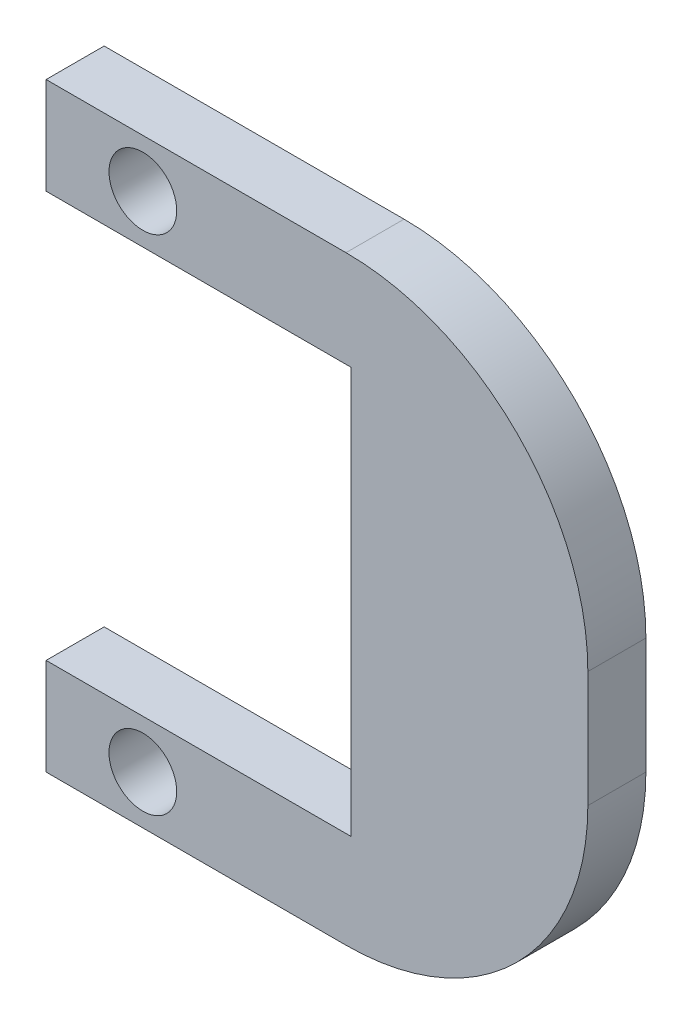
from build123d import *

# Parameters (mm, degrees)
SKETCH1_R           = 3.5
BOSS_EXTRUDE1_DEPTH = 6


with BuildPart() as part:
    # Sketch1 → Boss-Extrude1 (new body)
    with BuildSketch(Plane.XY):
        with BuildLine():
            Line((-28, 31), (3, 31))
            ThreePointArc((3, 31), (20.67766953, 23.67766953), (28, 6))
            Line((28, 6), (28, -6))
            ThreePointArc((28, -6), (20.67766953, -23.67766953), (3, -31))
            Line((3, -31), (-28, -31))
            Line((-28, -31), (-28, -21))
            Line((-28, -21), (3.5, -21))
            Line((3.5, -21), (3.5, 21))
            Line((3.5, 21), (-28, 21))
            Line((-28, 21), (-28, 31))
        make_face()
        with Locations((-18, 26)):
            Circle(SKETCH1_R, mode=Mode.SUBTRACT)
        with Locations(Location((-18, -26, 0), (0, 0, 180))):
            Circle(SKETCH1_R, mode=Mode.SUBTRACT)
    extrude(amount=BOSS_EXTRUDE1_DEPTH)


solid = part.part
